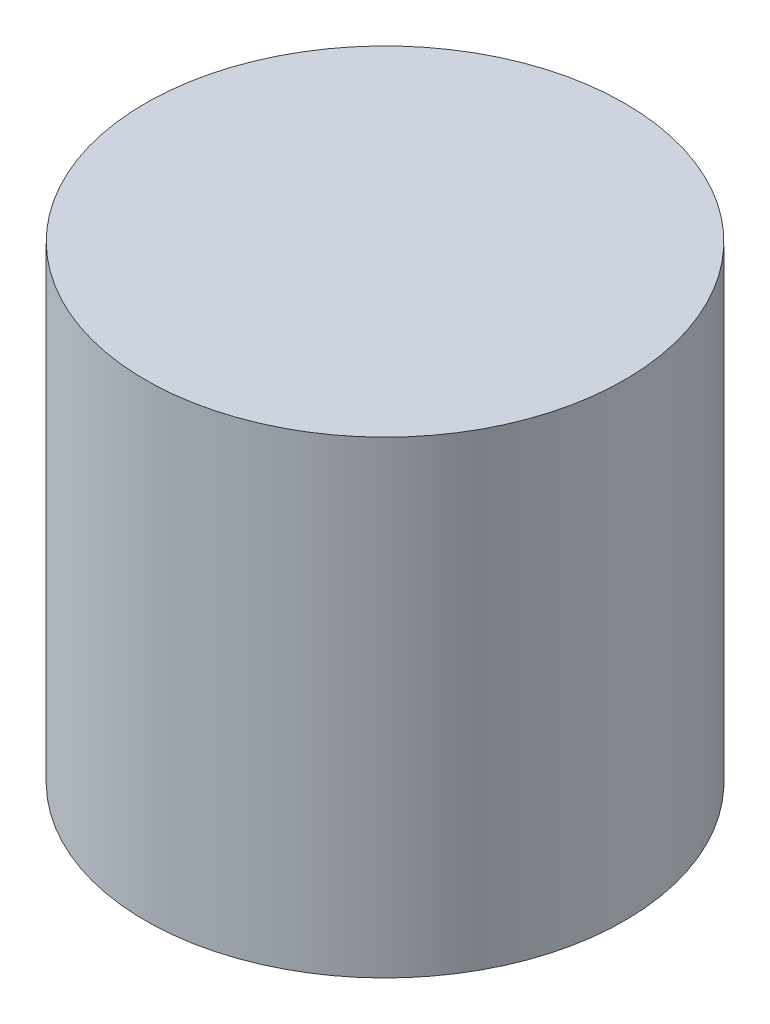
from build123d import *

# Parameters (mm, degrees)
SKETCH1_R           = 38.982101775
BOSS_EXTRUDE1_DEPTH = 76.2


with BuildPart() as part:
    # Sketch1 → Boss-Extrude1 (new body)
    with BuildSketch(Plane(origin=(0, 0, 0), x_dir=(1, 0, 0), z_dir=(0, 1, 0))):
        with Locations(Location((0, 0, 0), (0, 0, 90))):
            Circle(SKETCH1_R)
    extrude(amount=BOSS_EXTRUDE1_DEPTH)


solid = part.part
